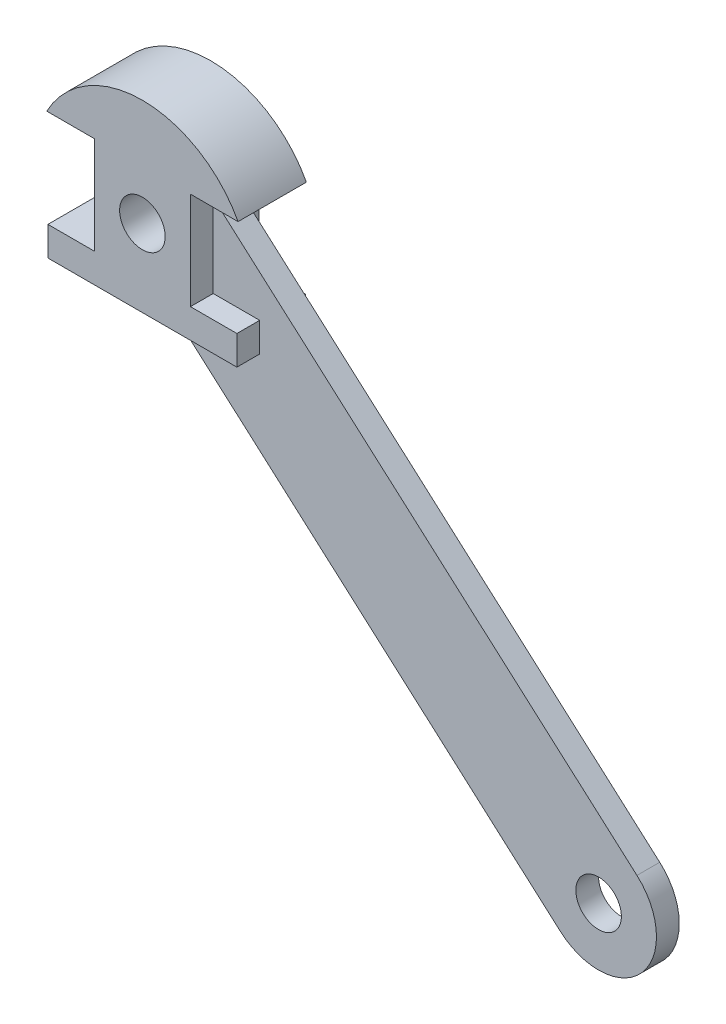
ISO-10303-21;
HEADER;
FILE_DESCRIPTION(('STEP AP214'),'2;1');
FILE_NAME('part.step','',(''),(''),'','','');
FILE_SCHEMA(('AUTOMOTIVE_DESIGN { 1 0 10303 214 1 1 1 1 }'));
ENDSEC;
DATA;
#1=APPLICATION_CONTEXT('core data for automotive mechanical design processes');
#2=APPLICATION_PROTOCOL_DEFINITION('international standard','automotive_design',2000,#1);
#3=PRODUCT_CONTEXT('',#1,'mechanical');
#4=PRODUCT('Part','Part','',(#3));
#5=PRODUCT_RELATED_PRODUCT_CATEGORY('part','',(#4));
#6=PRODUCT_DEFINITION_FORMATION('','',#4);
#7=PRODUCT_DEFINITION_CONTEXT('part definition',#1,'design');
#8=PRODUCT_DEFINITION('design','',#6,#7);
#9=PRODUCT_DEFINITION_SHAPE('','',#8);
#10=(LENGTH_UNIT() NAMED_UNIT(*) SI_UNIT(.MILLI.,.METRE.));
#11=(NAMED_UNIT(*) PLANE_ANGLE_UNIT() SI_UNIT($,.RADIAN.));
#12=(NAMED_UNIT(*) SI_UNIT($,.STERADIAN.) SOLID_ANGLE_UNIT());
#13=UNCERTAINTY_MEASURE_WITH_UNIT(LENGTH_MEASURE(1.E-05),#10,'distance_accuracy_value','');
#14=(GEOMETRIC_REPRESENTATION_CONTEXT(3) GLOBAL_UNCERTAINTY_ASSIGNED_CONTEXT((#13)) GLOBAL_UNIT_ASSIGNED_CONTEXT((#10,
#11,#12)) REPRESENTATION_CONTEXT('',''));
#15=CARTESIAN_POINT('',(0.,0.,0.));
#16=DIRECTION('',(0.,0.,1.));
#17=DIRECTION('',(1.,0.,0.));
#18=AXIS2_PLACEMENT_3D('',#15,#16,#17);
#19=CARTESIAN_POINT('',(-20.74,-16.94245,15.));
#20=DIRECTION('',(0.,1.,0.));
#21=DIRECTION('',(0.,0.,1.));
#22=AXIS2_PLACEMENT_3D('',#19,#20,#21);
#23=PLANE('',#22);
#24=DIRECTION('',(-1.,0.,0.));
#25=VECTOR('',#24,1.);
#26=CARTESIAN_POINT('',(-20.74,-16.94245,10.));
#27=LINE('',#26,#25);
#28=CARTESIAN_POINT('',(20.74,-16.94245,10.));
#29=VERTEX_POINT('',#28);
#30=CARTESIAN_POINT('',(-0.016382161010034,-16.94245,10.));
#31=VERTEX_POINT('',#30);
#32=EDGE_CURVE('E247',#29,#31,#27,.T.);
#33=ORIENTED_EDGE('',*,*,#32,.F.);
#34=DIRECTION('',(0.,0.,-1.));
#35=VECTOR('',#34,1.);
#36=CARTESIAN_POINT('',(20.74,-16.94245,15.));
#37=LINE('',#36,#35);
#38=CARTESIAN_POINT('',(20.74,-16.94245,15.));
#39=VERTEX_POINT('',#38);
#40=EDGE_CURVE('E193',#39,#29,#37,.T.);
#41=ORIENTED_EDGE('',*,*,#40,.F.);
#42=DIRECTION('',(1.,0.,0.));
#43=VECTOR('',#42,1.);
#44=CARTESIAN_POINT('',(-20.74,-16.94245,15.));
#45=LINE('',#44,#43);
#46=CARTESIAN_POINT('',(-20.74,-16.94245,15.));
#47=VERTEX_POINT('',#46);
#48=EDGE_CURVE('E257',#47,#39,#45,.T.);
#49=ORIENTED_EDGE('',*,*,#48,.F.);
#50=DIRECTION('',(0.,0.,-1.));
#51=VECTOR('',#50,1.);
#52=CARTESIAN_POINT('',(-20.74,-16.94245,15.));
#53=LINE('',#52,#51);
#54=CARTESIAN_POINT('',(-20.74,-16.94245,0.));
#55=VERTEX_POINT('',#54);
#56=EDGE_CURVE('E196',#47,#55,#53,.T.);
#57=ORIENTED_EDGE('',*,*,#56,.T.);
#58=DIRECTION('',(1.,0.,0.));
#59=VECTOR('',#58,1.);
#60=CARTESIAN_POINT('',(-20.74,-16.94245,0.));
#61=LINE('',#60,#59);
#62=CARTESIAN_POINT('',(20.74,-16.94245,0.));
#63=VERTEX_POINT('',#62);
#64=EDGE_CURVE('E160',#55,#63,#61,.T.);
#65=ORIENTED_EDGE('',*,*,#64,.T.);
#66=CARTESIAN_POINT('',(20.74,-16.94245,5.));
#67=VERTEX_POINT('',#66);
#68=EDGE_CURVE('E192',#67,#63,#37,.T.);
#69=ORIENTED_EDGE('',*,*,#68,.F.);
#70=DIRECTION('',(-1.,0.,0.));
#71=VECTOR('',#70,1.);
#72=CARTESIAN_POINT('',(-20.74,-16.94245,5.));
#73=LINE('',#72,#71);
#74=CARTESIAN_POINT('',(-0.016382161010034,-16.94245,5.));
#75=VERTEX_POINT('',#74);
#76=EDGE_CURVE('E237',#67,#75,#73,.T.);
#77=ORIENTED_EDGE('',*,*,#76,.T.);
#78=DIRECTION('',(0.,0.,-1.));
#79=VECTOR('',#78,1.);
#80=CARTESIAN_POINT('',(-0.016382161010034,-16.94245,15.));
#81=LINE('',#80,#79);
#82=EDGE_CURVE('E11',#31,#75,#81,.T.);
#83=ORIENTED_EDGE('',*,*,#82,.F.);
#84=EDGE_LOOP('',(#33,#41,#49,#57,#65,#69,#77,#83));
#85=FACE_BOUND('',#84,.T.);
#86=ADVANCED_FACE('F33',(#85),#23,.F.);
#87=CARTESIAN_POINT('',(20.74,-16.94245,15.));
#88=DIRECTION('',(-1.,0.,0.));
#89=DIRECTION('',(0.,0.,1.));
#90=AXIS2_PLACEMENT_3D('',#87,#88,#89);
#91=PLANE('',#90);
#92=DIRECTION('',(0.,-1.,0.));
#93=VECTOR('',#92,1.);
#94=CARTESIAN_POINT('',(20.74,-16.94245,10.));
#95=LINE('',#94,#93);
#96=CARTESIAN_POINT('',(20.74,-10.5429,10.));
#97=VERTEX_POINT('',#96);
#98=EDGE_CURVE('E239',#97,#29,#95,.T.);
#99=ORIENTED_EDGE('',*,*,#98,.F.);
#100=DIRECTION('',(0.,0.,-1.));
#101=VECTOR('',#100,1.);
#102=CARTESIAN_POINT('',(20.74,-10.5429,15.));
#103=LINE('',#102,#101);
#104=CARTESIAN_POINT('',(20.74,-10.5429,15.));
#105=VERTEX_POINT('',#104);
#106=EDGE_CURVE('E189',#105,#97,#103,.T.);
#107=ORIENTED_EDGE('',*,*,#106,.F.);
#108=DIRECTION('',(0.,1.,0.));
#109=VECTOR('',#108,1.);
#110=CARTESIAN_POINT('',(20.74,-16.94245,15.));
#111=LINE('',#110,#109);
#112=EDGE_CURVE('E259',#39,#105,#111,.T.);
#113=ORIENTED_EDGE('',*,*,#112,.F.);
#114=ORIENTED_EDGE('',*,*,#40,.T.);
#115=EDGE_LOOP('',(#99,#107,#113,#114));
#116=FACE_BOUND('',#115,.T.);
#117=ADVANCED_FACE('F288',(#116),#91,.F.);
#118=CARTESIAN_POINT('',(20.74,-10.5429,15.));
#119=DIRECTION('',(0.,-1.,0.));
#120=DIRECTION('',(1.,0.,0.));
#121=AXIS2_PLACEMENT_3D('',#118,#119,#120);
#122=PLANE('',#121);
#123=DIRECTION('',(1.,0.,0.));
#124=VECTOR('',#123,1.);
#125=CARTESIAN_POINT('',(20.74,-10.5429,10.));
#126=LINE('',#125,#124);
#127=CARTESIAN_POINT('',(10.54169,-10.5429,10.));
#128=VERTEX_POINT('',#127);
#129=EDGE_CURVE('E236',#128,#97,#126,.T.);
#130=ORIENTED_EDGE('',*,*,#129,.F.);
#131=DIRECTION('',(0.,0.,-1.));
#132=VECTOR('',#131,1.);
#133=CARTESIAN_POINT('',(10.54169,-10.5429,15.));
#134=LINE('',#133,#132);
#135=CARTESIAN_POINT('',(10.54169,-10.5429,15.));
#136=VERTEX_POINT('',#135);
#137=EDGE_CURVE('E185',#136,#128,#134,.T.);
#138=ORIENTED_EDGE('',*,*,#137,.F.);
#139=DIRECTION('',(-1.,0.,0.));
#140=VECTOR('',#139,1.);
#141=CARTESIAN_POINT('',(20.74,-10.5429,15.));
#142=LINE('',#141,#140);
#143=EDGE_CURVE('E261',#105,#136,#142,.T.);
#144=ORIENTED_EDGE('',*,*,#143,.F.);
#145=ORIENTED_EDGE('',*,*,#106,.T.);
#146=EDGE_LOOP('',(#130,#138,#144,#145));
#147=FACE_BOUND('',#146,.T.);
#148=ADVANCED_FACE('F291',(#147),#122,.F.);
#149=CARTESIAN_POINT('',(10.54169,-10.5429,15.));
#150=DIRECTION('',(-1.,0.,0.));
#151=DIRECTION('',(0.,0.,1.));
#152=AXIS2_PLACEMENT_3D('',#149,#150,#151);
#153=PLANE('',#152);
#154=DIRECTION('',(0.,-1.,0.));
#155=VECTOR('',#154,1.);
#156=CARTESIAN_POINT('',(10.54169,-10.5429,10.));
#157=LINE('',#156,#155);
#158=CARTESIAN_POINT('',(10.54169,7.63044423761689,10.));
#159=VERTEX_POINT('',#158);
#160=EDGE_CURVE('E225',#159,#128,#157,.T.);
#161=ORIENTED_EDGE('',*,*,#160,.F.);
#162=DIRECTION('',(0.,0.,1.));
#163=VECTOR('',#162,1.);
#164=CARTESIAN_POINT('',(10.54169,7.63044423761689,15.));
#165=LINE('',#164,#163);
#166=CARTESIAN_POINT('',(10.54169,7.63044423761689,5.));
#167=VERTEX_POINT('',#166);
#168=EDGE_CURVE('E41',#167,#159,#165,.T.);
#169=ORIENTED_EDGE('',*,*,#168,.F.);
#170=DIRECTION('',(0.,-1.,0.));
#171=VECTOR('',#170,1.);
#172=CARTESIAN_POINT('',(10.54169,-10.5429,5.));
#173=LINE('',#172,#171);
#174=CARTESIAN_POINT('',(10.54169,-10.5429,5.));
#175=VERTEX_POINT('',#174);
#176=EDGE_CURVE('E323',#167,#175,#173,.T.);
#177=ORIENTED_EDGE('',*,*,#176,.T.);
#178=CARTESIAN_POINT('',(10.54169,-10.5429,0.));
#179=VERTEX_POINT('',#178);
#180=EDGE_CURVE('E184',#175,#179,#134,.T.);
#181=ORIENTED_EDGE('',*,*,#180,.T.);
#182=DIRECTION('',(0.,1.,0.));
#183=VECTOR('',#182,1.);
#184=CARTESIAN_POINT('',(10.54169,-10.5429,0.));
#185=LINE('',#184,#183);
#186=CARTESIAN_POINT('',(10.54169,10.84581,0.));
#187=VERTEX_POINT('',#186);
#188=EDGE_CURVE('E169',#179,#187,#185,.T.);
#189=ORIENTED_EDGE('',*,*,#188,.T.);
#190=DIRECTION('',(0.,0.,-1.));
#191=VECTOR('',#190,1.);
#192=CARTESIAN_POINT('',(10.54169,10.84581,15.));
#193=LINE('',#192,#191);
#194=CARTESIAN_POINT('',(10.54169,10.84581,15.));
#195=VERTEX_POINT('',#194);
#196=EDGE_CURVE('E181',#195,#187,#193,.T.);
#197=ORIENTED_EDGE('',*,*,#196,.F.);
#198=DIRECTION('',(0.,1.,0.));
#199=VECTOR('',#198,1.);
#200=CARTESIAN_POINT('',(10.54169,-10.5429,15.));
#201=LINE('',#200,#199);
#202=EDGE_CURVE('E263',#136,#195,#201,.T.);
#203=ORIENTED_EDGE('',*,*,#202,.F.);
#204=ORIENTED_EDGE('',*,*,#137,.T.);
#205=EDGE_LOOP('',(#161,#169,#177,#181,#189,#197,#203,#204));
#206=FACE_BOUND('',#205,.T.);
#207=ADVANCED_FACE('F233',(#206),#153,.F.);
#208=CARTESIAN_POINT('',(-20.74,-10.5429,15.));
#209=DIRECTION('',(0.,-1.,0.));
#210=DIRECTION('',(1.,0.,0.));
#211=AXIS2_PLACEMENT_3D('',#208,#209,#210);
#212=PLANE('',#211);
#213=DIRECTION('',(-1.,0.,0.));
#214=VECTOR('',#213,1.);
#215=CARTESIAN_POINT('',(-20.74,-10.5429,0.));
#216=LINE('',#215,#214);
#217=CARTESIAN_POINT('',(-10.54169,-10.5429,0.));
#218=VERTEX_POINT('',#217);
#219=CARTESIAN_POINT('',(-20.74,-10.5429,0.));
#220=VERTEX_POINT('',#219);
#221=EDGE_CURVE('E154',#218,#220,#216,.T.);
#222=ORIENTED_EDGE('',*,*,#221,.T.);
#223=DIRECTION('',(0.,0.,-1.));
#224=VECTOR('',#223,1.);
#225=CARTESIAN_POINT('',(-20.74,-10.5429,15.));
#226=LINE('',#225,#224);
#227=CARTESIAN_POINT('',(-20.74,-10.5429,15.));
#228=VERTEX_POINT('',#227);
#229=EDGE_CURVE('E199',#228,#220,#226,.T.);
#230=ORIENTED_EDGE('',*,*,#229,.F.);
#231=DIRECTION('',(-1.,0.,0.));
#232=VECTOR('',#231,1.);
#233=CARTESIAN_POINT('',(-20.74,-10.5429,15.));
#234=LINE('',#233,#232);
#235=CARTESIAN_POINT('',(-10.54169,-10.5429,15.));
#236=VERTEX_POINT('',#235);
#237=EDGE_CURVE('E177',#236,#228,#234,.T.);
#238=ORIENTED_EDGE('',*,*,#237,.F.);
#239=DIRECTION('',(0.,0.,-1.));
#240=VECTOR('',#239,1.);
#241=CARTESIAN_POINT('',(-10.54169,-10.5429,15.));
#242=LINE('',#241,#240);
#243=EDGE_CURVE('E150',#236,#218,#242,.T.);
#244=ORIENTED_EDGE('',*,*,#243,.T.);
#245=EDGE_LOOP('',(#222,#230,#238,#244));
#246=FACE_BOUND('',#245,.T.);
#247=ADVANCED_FACE('F35',(#246),#212,.F.);
#248=CARTESIAN_POINT('',(-20.74,-16.94245,15.));
#249=DIRECTION('',(1.,0.,0.));
#250=DIRECTION('',(0.,0.,-1.));
#251=AXIS2_PLACEMENT_3D('',#248,#249,#250);
#252=PLANE('',#251);
#253=DIRECTION('',(0.,-1.,0.));
#254=VECTOR('',#253,1.);
#255=CARTESIAN_POINT('',(-20.74,-16.94245,0.));
#256=LINE('',#255,#254);
#257=EDGE_CURVE('E157',#220,#55,#256,.T.);
#258=ORIENTED_EDGE('',*,*,#257,.T.);
#259=ORIENTED_EDGE('',*,*,#56,.F.);
#260=DIRECTION('',(0.,-1.,0.));
#261=VECTOR('',#260,1.);
#262=CARTESIAN_POINT('',(-20.74,-16.94245,15.));
#263=LINE('',#262,#261);
#264=EDGE_CURVE('E105',#228,#47,#263,.T.);
#265=ORIENTED_EDGE('',*,*,#264,.F.);
#266=ORIENTED_EDGE('',*,*,#229,.T.);
#267=EDGE_LOOP('',(#258,#259,#265,#266));
#268=FACE_BOUND('',#267,.T.);
#269=ADVANCED_FACE('F279',(#268),#252,.F.);
#270=CARTESIAN_POINT('',(20.74,-10.5429,5.));
#271=VERTEX_POINT('',#270);
#272=CARTESIAN_POINT('',(20.74,-10.5429,0.));
#273=VERTEX_POINT('',#272);
#274=EDGE_CURVE('E188',#271,#273,#103,.T.);
#275=ORIENTED_EDGE('',*,*,#274,.F.);
#276=DIRECTION('',(0.,-1.,0.));
#277=VECTOR('',#276,1.);
#278=CARTESIAN_POINT('',(20.74,-16.94245,5.));
#279=LINE('',#278,#277);
#280=EDGE_CURVE('E242',#271,#67,#279,.T.);
#281=ORIENTED_EDGE('',*,*,#280,.T.);
#282=ORIENTED_EDGE('',*,*,#68,.T.);
#283=DIRECTION('',(0.,1.,0.));
#284=VECTOR('',#283,1.);
#285=CARTESIAN_POINT('',(20.74,-16.94245,0.));
#286=LINE('',#285,#284);
#287=EDGE_CURVE('E163',#63,#273,#286,.T.);
#288=ORIENTED_EDGE('',*,*,#287,.T.);
#289=EDGE_LOOP('',(#275,#281,#282,#288));
#290=FACE_BOUND('',#289,.T.);
#291=ADVANCED_FACE('F340',(#290),#91,.F.);
#292=ORIENTED_EDGE('',*,*,#180,.F.);
#293=DIRECTION('',(1.,0.,0.));
#294=VECTOR('',#293,1.);
#295=CARTESIAN_POINT('',(20.74,-10.5429,5.));
#296=LINE('',#295,#294);
#297=EDGE_CURVE('E48',#175,#271,#296,.T.);
#298=ORIENTED_EDGE('',*,*,#297,.T.);
#299=ORIENTED_EDGE('',*,*,#274,.T.);
#300=DIRECTION('',(-1.,0.,0.));
#301=VECTOR('',#300,1.);
#302=CARTESIAN_POINT('',(20.74,-10.5429,0.));
#303=LINE('',#302,#301);
#304=EDGE_CURVE('E166',#273,#179,#303,.T.);
#305=ORIENTED_EDGE('',*,*,#304,.T.);
#306=EDGE_LOOP('',(#292,#298,#299,#305));
#307=FACE_BOUND('',#306,.T.);
#308=ADVANCED_FACE('F345',(#307),#122,.F.);
#309=CARTESIAN_POINT('',(10.54169,10.84581,15.));
#310=DIRECTION('',(0.,1.,0.));
#311=DIRECTION('',(0.,0.,1.));
#312=AXIS2_PLACEMENT_3D('',#309,#310,#311);
#313=PLANE('',#312);
#314=DIRECTION('',(1.,0.,0.));
#315=VECTOR('',#314,1.);
#316=CARTESIAN_POINT('',(10.54169,10.84581,0.));
#317=LINE('',#316,#315);
#318=CARTESIAN_POINT('',(20.99169,10.84581,0.));
#319=VERTEX_POINT('',#318);
#320=EDGE_CURVE('E171',#187,#319,#317,.T.);
#321=ORIENTED_EDGE('',*,*,#320,.T.);
#322=DIRECTION('',(0.,0.,-1.));
#323=VECTOR('',#322,1.);
#324=CARTESIAN_POINT('',(20.99169,10.84581,15.));
#325=LINE('',#324,#323);
#326=CARTESIAN_POINT('',(20.99169,10.84581,15.));
#327=VERTEX_POINT('',#326);
#328=EDGE_CURVE('E145',#327,#319,#325,.T.);
#329=ORIENTED_EDGE('',*,*,#328,.F.);
#330=DIRECTION('',(1.,0.,0.));
#331=VECTOR('',#330,1.);
#332=CARTESIAN_POINT('',(10.54169,10.84581,15.));
#333=LINE('',#332,#331);
#334=EDGE_CURVE('E133',#195,#327,#333,.T.);
#335=ORIENTED_EDGE('',*,*,#334,.F.);
#336=ORIENTED_EDGE('',*,*,#196,.T.);
#337=EDGE_LOOP('',(#321,#329,#335,#336));
#338=FACE_BOUND('',#337,.T.);
#339=ADVANCED_FACE('F269',(#338),#313,.F.);
#340=CARTESIAN_POINT('',(0.,-0.369757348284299,15.));
#341=DIRECTION('',(0.,0.,-1.));
#342=DIRECTION('',(-1.,0.,0.));
#343=AXIS2_PLACEMENT_3D('',#340,#341,#342);
#344=CYLINDRICAL_SURFACE('',#343,23.8);
#345=CARTESIAN_POINT('',(0.,-0.369757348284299,0.));
#346=DIRECTION('',(0.,0.,1.));
#347=DIRECTION('',(1.,0.,0.));
#348=AXIS2_PLACEMENT_3D('',#345,#346,#347);
#349=CIRCLE('',#348,23.8);
#350=CARTESIAN_POINT('',(-20.99169,10.84581,0.));
#351=VERTEX_POINT('',#350);
#352=EDGE_CURVE('E142',#319,#351,#349,.T.);
#353=ORIENTED_EDGE('',*,*,#352,.T.);
#354=DIRECTION('',(0.,0.,-1.));
#355=VECTOR('',#354,1.);
#356=CARTESIAN_POINT('',(-20.99169,10.84581,15.));
#357=LINE('',#356,#355);
#358=CARTESIAN_POINT('',(-20.99169,10.84581,15.));
#359=VERTEX_POINT('',#358);
#360=EDGE_CURVE('E139',#359,#351,#357,.T.);
#361=ORIENTED_EDGE('',*,*,#360,.F.);
#362=CARTESIAN_POINT('',(0.,-0.369757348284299,15.));
#363=DIRECTION('',(0.,0.,1.));
#364=DIRECTION('',(1.,0.,0.));
#365=AXIS2_PLACEMENT_3D('',#362,#363,#364);
#366=CIRCLE('',#365,23.8);
#367=EDGE_CURVE('E126',#327,#359,#366,.T.);
#368=ORIENTED_EDGE('',*,*,#367,.F.);
#369=ORIENTED_EDGE('',*,*,#328,.T.);
#370=EDGE_LOOP('',(#353,#361,#368,#369));
#371=FACE_BOUND('',#370,.T.);
#372=ADVANCED_FACE('F140',(#371),#344,.T.);
#373=CARTESIAN_POINT('',(-10.54169,10.84581,15.));
#374=DIRECTION('',(0.,1.,0.));
#375=DIRECTION('',(0.,0.,1.));
#376=AXIS2_PLACEMENT_3D('',#373,#374,#375);
#377=PLANE('',#376);
#378=DIRECTION('',(1.,0.,0.));
#379=VECTOR('',#378,1.);
#380=CARTESIAN_POINT('',(-10.54169,10.84581,0.));
#381=LINE('',#380,#379);
#382=CARTESIAN_POINT('',(-10.54169,10.84581,0.));
#383=VERTEX_POINT('',#382);
#384=EDGE_CURVE('E174',#351,#383,#381,.T.);
#385=ORIENTED_EDGE('',*,*,#384,.T.);
#386=DIRECTION('',(0.,0.,-1.));
#387=VECTOR('',#386,1.);
#388=CARTESIAN_POINT('',(-10.54169,10.84581,15.));
#389=LINE('',#388,#387);
#390=CARTESIAN_POINT('',(-10.54169,10.84581,15.));
#391=VERTEX_POINT('',#390);
#392=EDGE_CURVE('E146',#391,#383,#389,.T.);
#393=ORIENTED_EDGE('',*,*,#392,.F.);
#394=DIRECTION('',(1.,0.,0.));
#395=VECTOR('',#394,1.);
#396=CARTESIAN_POINT('',(-10.54169,10.84581,15.));
#397=LINE('',#396,#395);
#398=EDGE_CURVE('E130',#359,#391,#397,.T.);
#399=ORIENTED_EDGE('',*,*,#398,.F.);
#400=ORIENTED_EDGE('',*,*,#360,.T.);
#401=EDGE_LOOP('',(#385,#393,#399,#400));
#402=FACE_BOUND('',#401,.T.);
#403=ADVANCED_FACE('F148',(#402),#377,.F.);
#404=CARTESIAN_POINT('',(-10.54169,-10.5429,15.));
#405=DIRECTION('',(1.,0.,0.));
#406=DIRECTION('',(0.,0.,-1.));
#407=AXIS2_PLACEMENT_3D('',#404,#405,#406);
#408=PLANE('',#407);
#409=DIRECTION('',(0.,-1.,0.));
#410=VECTOR('',#409,1.);
#411=CARTESIAN_POINT('',(-10.54169,-10.5429,0.));
#412=LINE('',#411,#410);
#413=EDGE_CURVE('E96',#383,#218,#412,.T.);
#414=ORIENTED_EDGE('',*,*,#413,.T.);
#415=ORIENTED_EDGE('',*,*,#243,.F.);
#416=DIRECTION('',(0.,-1.,0.));
#417=VECTOR('',#416,1.);
#418=CARTESIAN_POINT('',(-10.54169,-10.5429,15.));
#419=LINE('',#418,#417);
#420=EDGE_CURVE('E57',#391,#236,#419,.T.);
#421=ORIENTED_EDGE('',*,*,#420,.F.);
#422=ORIENTED_EDGE('',*,*,#392,.T.);
#423=EDGE_LOOP('',(#414,#415,#421,#422));
#424=FACE_BOUND('',#423,.T.);
#425=ADVANCED_FACE('F273',(#424),#408,.F.);
#426=CARTESIAN_POINT('',(0.,-0.369757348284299,15.));
#427=DIRECTION('',(0.,0.,1.));
#428=DIRECTION('',(1.,0.,0.));
#429=AXIS2_PLACEMENT_3D('',#426,#427,#428);
#430=PLANE('',#429);
#431=CARTESIAN_POINT('',(0.,0.,15.));
#432=DIRECTION('',(0.,0.,1.));
#433=DIRECTION('',(1.,0.,0.));
#434=AXIS2_PLACEMENT_3D('',#431,#432,#433);
#435=CIRCLE('',#434,5.);
#436=CARTESIAN_POINT('',(5.,0.,15.));
#437=VERTEX_POINT('',#436);
#438=EDGE_CURVE('E250',#437,#437,#435,.T.);
#439=ORIENTED_EDGE('',*,*,#438,.F.);
#440=EDGE_LOOP('',(#439));
#441=FACE_BOUND('',#440,.T.);
#442=ORIENTED_EDGE('',*,*,#237,.T.);
#443=ORIENTED_EDGE('',*,*,#264,.T.);
#444=ORIENTED_EDGE('',*,*,#48,.T.);
#445=ORIENTED_EDGE('',*,*,#112,.T.);
#446=ORIENTED_EDGE('',*,*,#143,.T.);
#447=ORIENTED_EDGE('',*,*,#202,.T.);
#448=ORIENTED_EDGE('',*,*,#334,.T.);
#449=ORIENTED_EDGE('',*,*,#367,.T.);
#450=ORIENTED_EDGE('',*,*,#398,.T.);
#451=ORIENTED_EDGE('',*,*,#420,.T.);
#452=EDGE_LOOP('',(#442,#443,#444,#445,#446,#447,#448,#449,#450,#451));
#453=FACE_BOUND('',#452,.T.);
#454=ADVANCED_FACE('F128',(#441,#453),#430,.T.);
#455=CARTESIAN_POINT('',(0.,-0.369757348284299,0.));
#456=DIRECTION('',(0.,0.,1.));
#457=DIRECTION('',(1.,0.,0.));
#458=AXIS2_PLACEMENT_3D('',#455,#456,#457);
#459=PLANE('',#458);
#460=CARTESIAN_POINT('',(0.,0.,0.));
#461=DIRECTION('',(0.,0.,1.));
#462=DIRECTION('',(1.,0.,0.));
#463=AXIS2_PLACEMENT_3D('',#460,#461,#462);
#464=CIRCLE('',#463,5.);
#465=CARTESIAN_POINT('',(5.,0.,0.));
#466=VERTEX_POINT('',#465);
#467=EDGE_CURVE('E158',#466,#466,#464,.T.);
#468=ORIENTED_EDGE('',*,*,#467,.T.);
#469=EDGE_LOOP('',(#468));
#470=FACE_BOUND('',#469,.T.);
#471=ORIENTED_EDGE('',*,*,#221,.F.);
#472=ORIENTED_EDGE('',*,*,#413,.F.);
#473=ORIENTED_EDGE('',*,*,#384,.F.);
#474=ORIENTED_EDGE('',*,*,#352,.F.);
#475=ORIENTED_EDGE('',*,*,#320,.F.);
#476=ORIENTED_EDGE('',*,*,#188,.F.);
#477=ORIENTED_EDGE('',*,*,#304,.F.);
#478=ORIENTED_EDGE('',*,*,#287,.F.);
#479=ORIENTED_EDGE('',*,*,#64,.F.);
#480=ORIENTED_EDGE('',*,*,#257,.F.);
#481=EDGE_LOOP('',(#471,#472,#473,#474,#475,#476,#477,#478,#479,#480));
#482=FACE_BOUND('',#481,.T.);
#483=ADVANCED_FACE('F272',(#470,#482),#459,.F.);
#484=CARTESIAN_POINT('',(0.,0.,0.));
#485=DIRECTION('',(0.,0.,1.));
#486=DIRECTION('',(1.,0.,0.));
#487=AXIS2_PLACEMENT_3D('',#484,#485,#486);
#488=CYLINDRICAL_SURFACE('',#487,5.);
#489=ORIENTED_EDGE('',*,*,#467,.F.);
#490=EDGE_LOOP('',(#489));
#491=FACE_BOUND('',#490,.T.);
#492=ORIENTED_EDGE('',*,*,#438,.T.);
#493=EDGE_LOOP('',(#492));
#494=FACE_BOUND('',#493,.T.);
#495=ADVANCED_FACE('F397',(#491,#494),#488,.F.);
#496=CARTESIAN_POINT('',(-7.97225020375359,-9.90369254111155,10.));
#497=DIRECTION('',(0.662620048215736,0.748955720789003,0.));
#498=DIRECTION('',(-0.748955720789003,0.662620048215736,0.));
#499=AXIS2_PLACEMENT_3D('',#496,#497,#498);
#500=PLANE('',#499);
#501=DIRECTION('',(0.748955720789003,-0.662620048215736,0.));
#502=VECTOR('',#501,1.);
#503=CARTESIAN_POINT('',(-7.97225020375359,-9.90369254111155,10.));
#504=LINE('',#503,#502);
#505=CARTESIAN_POINT('',(86.7021019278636,-93.6644837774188,10.));
#506=VERTEX_POINT('',#505);
#507=EDGE_CURVE('E312',#31,#506,#504,.T.);
#508=ORIENTED_EDGE('',*,*,#507,.F.);
#509=ORIENTED_EDGE('',*,*,#82,.T.);
#510=DIRECTION('',(0.748955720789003,-0.662620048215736,0.));
#511=VECTOR('',#510,1.);
#512=CARTESIAN_POINT('',(-7.97225020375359,-9.90369254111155,5.));
#513=LINE('',#512,#511);
#514=CARTESIAN_POINT('',(86.7021019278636,-93.6644837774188,5.));
#515=VERTEX_POINT('',#514);
#516=EDGE_CURVE('E320',#75,#515,#513,.T.);
#517=ORIENTED_EDGE('',*,*,#516,.T.);
#518=DIRECTION('',(0.,0.,-1.));
#519=VECTOR('',#518,1.);
#520=CARTESIAN_POINT('',(86.7021019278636,-93.6644837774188,10.));
#521=LINE('',#520,#519);
#522=EDGE_CURVE('E317',#506,#515,#521,.T.);
#523=ORIENTED_EDGE('',*,*,#522,.F.);
#524=EDGE_LOOP('',(#508,#509,#517,#523));
#525=FACE_BOUND('',#524,.T.);
#526=ADVANCED_FACE('F318',(#525),#500,.F.);
#527=CARTESIAN_POINT('',(8.8582990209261,9.11978276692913,10.));
#528=DIRECTION('',(-0.662620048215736,-0.748955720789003,0.));
#529=DIRECTION('',(0.748955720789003,-0.662620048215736,0.));
#530=AXIS2_PLACEMENT_3D('',#527,#528,#529);
#531=PLANE('',#530);
#532=DIRECTION('',(-0.748955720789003,0.662620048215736,0.));
#533=VECTOR('',#532,1.);
#534=CARTESIAN_POINT('',(8.8582990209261,9.11978276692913,5.));
#535=LINE('',#534,#533);
#536=CARTESIAN_POINT('',(103.532651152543,-74.6410084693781,5.));
#537=VERTEX_POINT('',#536);
#538=EDGE_CURVE('E213',#537,#167,#535,.T.);
#539=ORIENTED_EDGE('',*,*,#538,.T.);
#540=ORIENTED_EDGE('',*,*,#168,.T.);
#541=DIRECTION('',(-0.748955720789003,0.662620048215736,0.));
#542=VECTOR('',#541,1.);
#543=CARTESIAN_POINT('',(8.8582990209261,9.11978276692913,10.));
#544=LINE('',#543,#542);
#545=CARTESIAN_POINT('',(103.532651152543,-74.6410084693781,10.));
#546=VERTEX_POINT('',#545);
#547=EDGE_CURVE('E210',#546,#159,#544,.T.);
#548=ORIENTED_EDGE('',*,*,#547,.F.);
#549=DIRECTION('',(0.,0.,-1.));
#550=VECTOR('',#549,1.);
#551=CARTESIAN_POINT('',(103.532651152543,-74.6410084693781,10.));
#552=LINE('',#551,#550);
#553=EDGE_CURVE('E231',#546,#537,#552,.T.);
#554=ORIENTED_EDGE('',*,*,#553,.T.);
#555=EDGE_LOOP('',(#539,#540,#548,#554));
#556=FACE_BOUND('',#555,.T.);
#557=ADVANCED_FACE('F207',(#556),#531,.F.);
#558=CARTESIAN_POINT('',(2.90202083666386,-2.56749115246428,10.));
#559=DIRECTION('',(0.,0.,-1.));
#560=DIRECTION('',(-1.,0.,0.));
#561=AXIS2_PLACEMENT_3D('',#558,#559,#560);
#562=PLANE('',#561);
#563=CARTESIAN_POINT('',(95.1173765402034,-84.1527461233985,10.));
#564=DIRECTION('',(0.,0.,-1.));
#565=DIRECTION('',(-1.,0.,0.));
#566=AXIS2_PLACEMENT_3D('',#563,#564,#565);
#567=CIRCLE('',#566,5.00000000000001);
#568=CARTESIAN_POINT('',(90.1173765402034,-84.1527461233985,10.));
#569=VERTEX_POINT('',#568);
#570=EDGE_CURVE('E331',#569,#569,#567,.F.);
#571=ORIENTED_EDGE('',*,*,#570,.F.);
#572=EDGE_LOOP('',(#571));
#573=FACE_BOUND('',#572,.T.);
#574=ORIENTED_EDGE('',*,*,#98,.T.);
#575=ORIENTED_EDGE('',*,*,#32,.T.);
#576=ORIENTED_EDGE('',*,*,#507,.T.);
#577=CARTESIAN_POINT('',(95.1173765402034,-84.1527461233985,10.));
#578=DIRECTION('',(0.,0.,1.));
#579=DIRECTION('',(-1.,0.,0.));
#580=AXIS2_PLACEMENT_3D('',#577,#578,#579);
#581=CIRCLE('',#580,12.7);
#582=EDGE_CURVE('E229',#506,#546,#581,.T.);
#583=ORIENTED_EDGE('',*,*,#582,.T.);
#584=ORIENTED_EDGE('',*,*,#547,.T.);
#585=ORIENTED_EDGE('',*,*,#160,.T.);
#586=ORIENTED_EDGE('',*,*,#129,.T.);
#587=EDGE_LOOP('',(#574,#575,#576,#583,#584,#585,#586));
#588=FACE_BOUND('',#587,.T.);
#589=ADVANCED_FACE('F223',(#573,#588),#562,.F.);
#590=CARTESIAN_POINT('',(2.90202083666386,-2.56749115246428,5.));
#591=DIRECTION('',(0.,0.,-1.));
#592=DIRECTION('',(-1.,0.,0.));
#593=AXIS2_PLACEMENT_3D('',#590,#591,#592);
#594=PLANE('',#593);
#595=CARTESIAN_POINT('',(95.1173765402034,-84.1527461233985,5.));
#596=DIRECTION('',(0.,0.,1.));
#597=DIRECTION('',(1.,0.,0.));
#598=AXIS2_PLACEMENT_3D('',#595,#596,#597);
#599=CIRCLE('',#598,5.00000000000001);
#600=CARTESIAN_POINT('',(100.117376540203,-84.1527461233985,5.));
#601=VERTEX_POINT('',#600);
#602=EDGE_CURVE('E525',#601,#601,#599,.T.);
#603=ORIENTED_EDGE('',*,*,#602,.T.);
#604=EDGE_LOOP('',(#603));
#605=FACE_BOUND('',#604,.T.);
#606=ORIENTED_EDGE('',*,*,#76,.F.);
#607=ORIENTED_EDGE('',*,*,#280,.F.);
#608=ORIENTED_EDGE('',*,*,#297,.F.);
#609=ORIENTED_EDGE('',*,*,#176,.F.);
#610=ORIENTED_EDGE('',*,*,#538,.F.);
#611=CARTESIAN_POINT('',(95.1173765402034,-84.1527461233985,5.));
#612=DIRECTION('',(0.,0.,1.));
#613=DIRECTION('',(-1.,0.,0.));
#614=AXIS2_PLACEMENT_3D('',#611,#612,#613);
#615=CIRCLE('',#614,12.7);
#616=EDGE_CURVE('E330',#515,#537,#615,.T.);
#617=ORIENTED_EDGE('',*,*,#616,.F.);
#618=ORIENTED_EDGE('',*,*,#516,.F.);
#619=EDGE_LOOP('',(#606,#607,#608,#609,#610,#617,#618));
#620=FACE_BOUND('',#619,.T.);
#621=ADVANCED_FACE('F346',(#605,#620),#594,.T.);
#622=CARTESIAN_POINT('',(95.1173765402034,-84.1527461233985,10.));
#623=DIRECTION('',(0.,0.,-1.));
#624=DIRECTION('',(-1.,0.,0.));
#625=AXIS2_PLACEMENT_3D('',#622,#623,#624);
#626=CYLINDRICAL_SURFACE('',#625,12.7);
#627=ORIENTED_EDGE('',*,*,#616,.T.);
#628=ORIENTED_EDGE('',*,*,#553,.F.);
#629=ORIENTED_EDGE('',*,*,#582,.F.);
#630=ORIENTED_EDGE('',*,*,#522,.T.);
#631=EDGE_LOOP('',(#627,#628,#629,#630));
#632=FACE_BOUND('',#631,.T.);
#633=ADVANCED_FACE('F325',(#632),#626,.T.);
#634=CARTESIAN_POINT('',(95.1173765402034,-84.1527461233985,15.));
#635=DIRECTION('',(0.,0.,-1.));
#636=DIRECTION('',(-1.,0.,0.));
#637=AXIS2_PLACEMENT_3D('',#634,#635,#636);
#638=CYLINDRICAL_SURFACE('',#637,5.00000000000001);
#639=ORIENTED_EDGE('',*,*,#602,.F.);
#640=EDGE_LOOP('',(#639));
#641=FACE_BOUND('',#640,.T.);
#642=ORIENTED_EDGE('',*,*,#570,.T.);
#643=EDGE_LOOP('',(#642));
#644=FACE_BOUND('',#643,.T.);
#645=ADVANCED_FACE('F354',(#641,#644),#638,.F.);
#646=CLOSED_SHELL('',(#86,#117,#148,#207,#247,#269,#291,#308,#339,#372,#403,#425,#454,#483,#495,
#526,#557,#589,#621,#633,#645));
#647=MANIFOLD_SOLID_BREP('B2',#646);
#648=ADVANCED_BREP_SHAPE_REPRESENTATION('',(#18,#647),#14);
#649=SHAPE_DEFINITION_REPRESENTATION(#9,#648);
ENDSEC;
END-ISO-10303-21;
